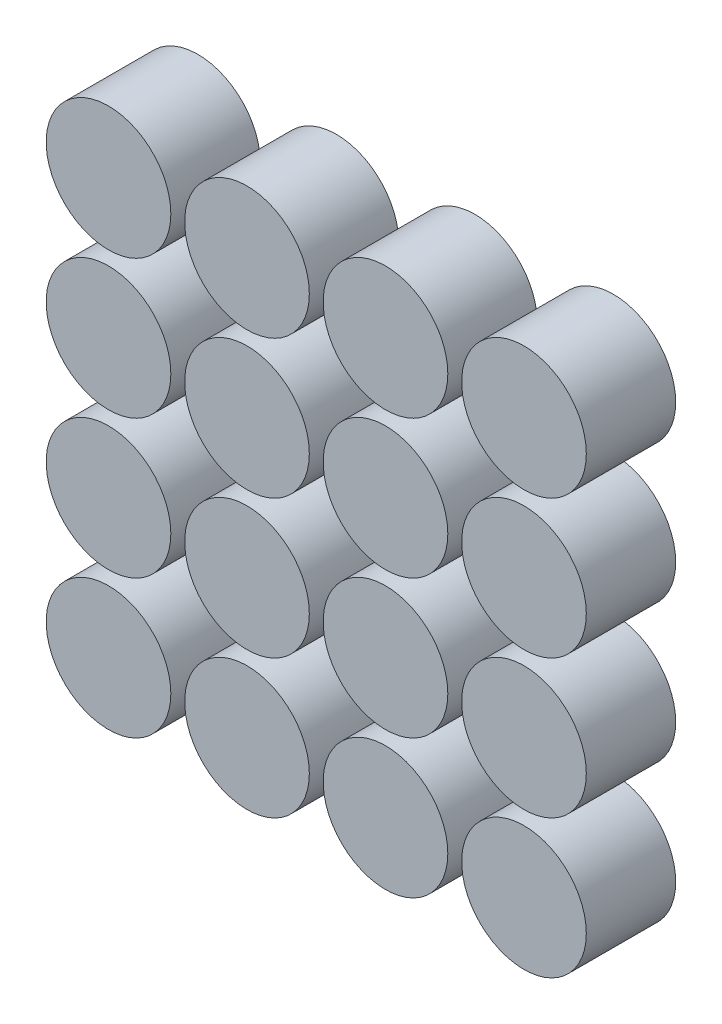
ISO-10303-21;
HEADER;
FILE_DESCRIPTION(('STEP AP214'),'2;1');
FILE_NAME('part.step','',(''),(''),'','','');
FILE_SCHEMA(('AUTOMOTIVE_DESIGN { 1 0 10303 214 1 1 1 1 }'));
ENDSEC;
DATA;
#1=APPLICATION_CONTEXT('core data for automotive mechanical design processes');
#2=APPLICATION_PROTOCOL_DEFINITION('international standard','automotive_design',2000,#1);
#3=PRODUCT_CONTEXT('',#1,'mechanical');
#4=PRODUCT('Part','Part','',(#3));
#5=PRODUCT_RELATED_PRODUCT_CATEGORY('part','',(#4));
#6=PRODUCT_DEFINITION_FORMATION('','',#4);
#7=PRODUCT_DEFINITION_CONTEXT('part definition',#1,'design');
#8=PRODUCT_DEFINITION('design','',#6,#7);
#9=PRODUCT_DEFINITION_SHAPE('','',#8);
#10=(LENGTH_UNIT() NAMED_UNIT(*) SI_UNIT(.MILLI.,.METRE.));
#11=(NAMED_UNIT(*) PLANE_ANGLE_UNIT() SI_UNIT($,.RADIAN.));
#12=(NAMED_UNIT(*) SI_UNIT($,.STERADIAN.) SOLID_ANGLE_UNIT());
#13=UNCERTAINTY_MEASURE_WITH_UNIT(LENGTH_MEASURE(1.E-05),#10,'distance_accuracy_value','');
#14=(GEOMETRIC_REPRESENTATION_CONTEXT(3) GLOBAL_UNCERTAINTY_ASSIGNED_CONTEXT((#13)) GLOBAL_UNIT_ASSIGNED_CONTEXT((#10,
#11,#12)) REPRESENTATION_CONTEXT('',''));
#15=CARTESIAN_POINT('',(0.,0.,0.));
#16=DIRECTION('',(0.,0.,1.));
#17=DIRECTION('',(1.,0.,0.));
#18=AXIS2_PLACEMENT_3D('',#15,#16,#17);
#19=CARTESIAN_POINT('',(16.5,16.5,7.1));
#20=DIRECTION('',(0.,0.,-1.));
#21=DIRECTION('',(-1.,0.,0.));
#22=AXIS2_PLACEMENT_3D('',#19,#20,#21);
#23=CYLINDRICAL_SURFACE('',#22,4.95);
#24=CARTESIAN_POINT('',(16.5,16.5,7.1));
#25=DIRECTION('',(0.,0.,1.));
#26=DIRECTION('',(1.,0.,0.));
#27=AXIS2_PLACEMENT_3D('',#24,#25,#26);
#28=CIRCLE('',#27,4.95);
#29=CARTESIAN_POINT('',(21.45,16.5,7.1));
#30=VERTEX_POINT('',#29);
#31=EDGE_CURVE('E54',#30,#30,#28,.T.);
#32=ORIENTED_EDGE('',*,*,#31,.F.);
#33=EDGE_LOOP('',(#32));
#34=FACE_BOUND('',#33,.T.);
#35=CARTESIAN_POINT('',(16.5,16.5,0.));
#36=DIRECTION('',(0.,0.,1.));
#37=DIRECTION('',(1.,0.,0.));
#38=AXIS2_PLACEMENT_3D('',#35,#36,#37);
#39=CIRCLE('',#38,4.95);
#40=CARTESIAN_POINT('',(21.45,16.5,0.));
#41=VERTEX_POINT('',#40);
#42=EDGE_CURVE('E11',#41,#41,#39,.T.);
#43=ORIENTED_EDGE('',*,*,#42,.T.);
#44=EDGE_LOOP('',(#43));
#45=FACE_BOUND('',#44,.T.);
#46=ADVANCED_FACE('F50',(#34,#45),#23,.T.);
#47=CARTESIAN_POINT('',(16.5,16.5,7.1));
#48=DIRECTION('',(0.,0.,1.));
#49=DIRECTION('',(1.,0.,0.));
#50=AXIS2_PLACEMENT_3D('',#47,#48,#49);
#51=PLANE('',#50);
#52=ORIENTED_EDGE('',*,*,#31,.T.);
#53=EDGE_LOOP('',(#52));
#54=FACE_BOUND('',#53,.T.);
#55=ADVANCED_FACE('F52',(#54),#51,.T.);
#56=CARTESIAN_POINT('',(16.5,16.5,0.));
#57=DIRECTION('',(0.,0.,1.));
#58=DIRECTION('',(1.,0.,0.));
#59=AXIS2_PLACEMENT_3D('',#56,#57,#58);
#60=PLANE('',#59);
#61=ORIENTED_EDGE('',*,*,#42,.F.);
#62=EDGE_LOOP('',(#61));
#63=FACE_BOUND('',#62,.T.);
#64=ADVANCED_FACE('F69',(#63),#60,.F.);
#65=CLOSED_SHELL('',(#46,#55,#64));
#66=MANIFOLD_SOLID_BREP('B2',#65);
#67=CARTESIAN_POINT('',(5.5,16.5,7.1));
#68=DIRECTION('',(0.,0.,-1.));
#69=DIRECTION('',(-1.,0.,0.));
#70=AXIS2_PLACEMENT_3D('',#67,#68,#69);
#71=CYLINDRICAL_SURFACE('',#70,4.95);
#72=CARTESIAN_POINT('',(5.5,16.5,7.1));
#73=DIRECTION('',(0.,0.,1.));
#74=DIRECTION('',(1.,0.,0.));
#75=AXIS2_PLACEMENT_3D('',#72,#73,#74);
#76=CIRCLE('',#75,4.95);
#77=CARTESIAN_POINT('',(10.45,16.5,7.1));
#78=VERTEX_POINT('',#77);
#79=EDGE_CURVE('E103',#78,#78,#76,.T.);
#80=ORIENTED_EDGE('',*,*,#79,.F.);
#81=EDGE_LOOP('',(#80));
#82=FACE_BOUND('',#81,.T.);
#83=CARTESIAN_POINT('',(5.5,16.5,0.));
#84=DIRECTION('',(0.,0.,1.));
#85=DIRECTION('',(1.,0.,0.));
#86=AXIS2_PLACEMENT_3D('',#83,#84,#85);
#87=CIRCLE('',#86,4.95);
#88=CARTESIAN_POINT('',(10.45,16.5,0.));
#89=VERTEX_POINT('',#88);
#90=EDGE_CURVE('E49',#89,#89,#87,.T.);
#91=ORIENTED_EDGE('',*,*,#90,.T.);
#92=EDGE_LOOP('',(#91));
#93=FACE_BOUND('',#92,.T.);
#94=ADVANCED_FACE('F99',(#82,#93),#71,.T.);
#95=CARTESIAN_POINT('',(5.5,16.5,7.1));
#96=DIRECTION('',(0.,0.,1.));
#97=DIRECTION('',(1.,0.,0.));
#98=AXIS2_PLACEMENT_3D('',#95,#96,#97);
#99=PLANE('',#98);
#100=ORIENTED_EDGE('',*,*,#79,.T.);
#101=EDGE_LOOP('',(#100));
#102=FACE_BOUND('',#101,.T.);
#103=ADVANCED_FACE('F101',(#102),#99,.T.);
#104=CARTESIAN_POINT('',(5.5,16.5,0.));
#105=DIRECTION('',(0.,0.,1.));
#106=DIRECTION('',(1.,0.,0.));
#107=AXIS2_PLACEMENT_3D('',#104,#105,#106);
#108=PLANE('',#107);
#109=ORIENTED_EDGE('',*,*,#90,.F.);
#110=EDGE_LOOP('',(#109));
#111=FACE_BOUND('',#110,.T.);
#112=ADVANCED_FACE('F118',(#111),#108,.F.);
#113=CLOSED_SHELL('',(#94,#103,#112));
#114=MANIFOLD_SOLID_BREP('B6',#113);
#115=CARTESIAN_POINT('',(-5.5,16.5,7.1));
#116=DIRECTION('',(0.,0.,-1.));
#117=DIRECTION('',(-1.,0.,0.));
#118=AXIS2_PLACEMENT_3D('',#115,#116,#117);
#119=CYLINDRICAL_SURFACE('',#118,4.95);
#120=CARTESIAN_POINT('',(-5.5,16.5,7.1));
#121=DIRECTION('',(0.,0.,1.));
#122=DIRECTION('',(1.,0.,0.));
#123=AXIS2_PLACEMENT_3D('',#120,#121,#122);
#124=CIRCLE('',#123,4.95);
#125=CARTESIAN_POINT('',(-0.549999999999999,16.5,7.1));
#126=VERTEX_POINT('',#125);
#127=EDGE_CURVE('E152',#126,#126,#124,.T.);
#128=ORIENTED_EDGE('',*,*,#127,.F.);
#129=EDGE_LOOP('',(#128));
#130=FACE_BOUND('',#129,.T.);
#131=CARTESIAN_POINT('',(-5.5,16.5,0.));
#132=DIRECTION('',(0.,0.,1.));
#133=DIRECTION('',(1.,0.,0.));
#134=AXIS2_PLACEMENT_3D('',#131,#132,#133);
#135=CIRCLE('',#134,4.95);
#136=CARTESIAN_POINT('',(-0.549999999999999,16.5,0.));
#137=VERTEX_POINT('',#136);
#138=EDGE_CURVE('E98',#137,#137,#135,.T.);
#139=ORIENTED_EDGE('',*,*,#138,.T.);
#140=EDGE_LOOP('',(#139));
#141=FACE_BOUND('',#140,.T.);
#142=ADVANCED_FACE('F148',(#130,#141),#119,.T.);
#143=CARTESIAN_POINT('',(-5.5,16.5,7.1));
#144=DIRECTION('',(0.,0.,1.));
#145=DIRECTION('',(1.,0.,0.));
#146=AXIS2_PLACEMENT_3D('',#143,#144,#145);
#147=PLANE('',#146);
#148=ORIENTED_EDGE('',*,*,#127,.T.);
#149=EDGE_LOOP('',(#148));
#150=FACE_BOUND('',#149,.T.);
#151=ADVANCED_FACE('F150',(#150),#147,.T.);
#152=CARTESIAN_POINT('',(-5.5,16.5,0.));
#153=DIRECTION('',(0.,0.,1.));
#154=DIRECTION('',(1.,0.,0.));
#155=AXIS2_PLACEMENT_3D('',#152,#153,#154);
#156=PLANE('',#155);
#157=ORIENTED_EDGE('',*,*,#138,.F.);
#158=EDGE_LOOP('',(#157));
#159=FACE_BOUND('',#158,.T.);
#160=ADVANCED_FACE('F167',(#159),#156,.F.);
#161=CLOSED_SHELL('',(#142,#151,#160));
#162=MANIFOLD_SOLID_BREP('B44',#161);
#163=CARTESIAN_POINT('',(-16.5,16.5,7.1));
#164=DIRECTION('',(0.,0.,-1.));
#165=DIRECTION('',(-1.,0.,0.));
#166=AXIS2_PLACEMENT_3D('',#163,#164,#165);
#167=CYLINDRICAL_SURFACE('',#166,4.95);
#168=CARTESIAN_POINT('',(-16.5,16.5,7.1));
#169=DIRECTION('',(0.,0.,1.));
#170=DIRECTION('',(1.,0.,0.));
#171=AXIS2_PLACEMENT_3D('',#168,#169,#170);
#172=CIRCLE('',#171,4.95);
#173=CARTESIAN_POINT('',(-11.55,16.5,7.1));
#174=VERTEX_POINT('',#173);
#175=EDGE_CURVE('E201',#174,#174,#172,.T.);
#176=ORIENTED_EDGE('',*,*,#175,.F.);
#177=EDGE_LOOP('',(#176));
#178=FACE_BOUND('',#177,.T.);
#179=CARTESIAN_POINT('',(-16.5,16.5,0.));
#180=DIRECTION('',(0.,0.,1.));
#181=DIRECTION('',(1.,0.,0.));
#182=AXIS2_PLACEMENT_3D('',#179,#180,#181);
#183=CIRCLE('',#182,4.95);
#184=CARTESIAN_POINT('',(-11.55,16.5,0.));
#185=VERTEX_POINT('',#184);
#186=EDGE_CURVE('E147',#185,#185,#183,.T.);
#187=ORIENTED_EDGE('',*,*,#186,.T.);
#188=EDGE_LOOP('',(#187));
#189=FACE_BOUND('',#188,.T.);
#190=ADVANCED_FACE('F197',(#178,#189),#167,.T.);
#191=CARTESIAN_POINT('',(-16.5,16.5,7.1));
#192=DIRECTION('',(0.,0.,1.));
#193=DIRECTION('',(1.,0.,0.));
#194=AXIS2_PLACEMENT_3D('',#191,#192,#193);
#195=PLANE('',#194);
#196=ORIENTED_EDGE('',*,*,#175,.T.);
#197=EDGE_LOOP('',(#196));
#198=FACE_BOUND('',#197,.T.);
#199=ADVANCED_FACE('F199',(#198),#195,.T.);
#200=CARTESIAN_POINT('',(-16.5,16.5,0.));
#201=DIRECTION('',(0.,0.,1.));
#202=DIRECTION('',(1.,0.,0.));
#203=AXIS2_PLACEMENT_3D('',#200,#201,#202);
#204=PLANE('',#203);
#205=ORIENTED_EDGE('',*,*,#186,.F.);
#206=EDGE_LOOP('',(#205));
#207=FACE_BOUND('',#206,.T.);
#208=ADVANCED_FACE('F216',(#207),#204,.F.);
#209=CLOSED_SHELL('',(#190,#199,#208));
#210=MANIFOLD_SOLID_BREP('B93',#209);
#211=CARTESIAN_POINT('',(16.5,5.5,7.1));
#212=DIRECTION('',(0.,0.,-1.));
#213=DIRECTION('',(-1.,0.,0.));
#214=AXIS2_PLACEMENT_3D('',#211,#212,#213);
#215=CYLINDRICAL_SURFACE('',#214,4.95);
#216=CARTESIAN_POINT('',(16.5,5.5,7.1));
#217=DIRECTION('',(0.,0.,1.));
#218=DIRECTION('',(1.,0.,0.));
#219=AXIS2_PLACEMENT_3D('',#216,#217,#218);
#220=CIRCLE('',#219,4.95);
#221=CARTESIAN_POINT('',(21.45,5.5,7.1));
#222=VERTEX_POINT('',#221);
#223=EDGE_CURVE('E250',#222,#222,#220,.T.);
#224=ORIENTED_EDGE('',*,*,#223,.F.);
#225=EDGE_LOOP('',(#224));
#226=FACE_BOUND('',#225,.T.);
#227=CARTESIAN_POINT('',(16.5,5.5,0.));
#228=DIRECTION('',(0.,0.,1.));
#229=DIRECTION('',(1.,0.,0.));
#230=AXIS2_PLACEMENT_3D('',#227,#228,#229);
#231=CIRCLE('',#230,4.95);
#232=CARTESIAN_POINT('',(21.45,5.5,0.));
#233=VERTEX_POINT('',#232);
#234=EDGE_CURVE('E196',#233,#233,#231,.T.);
#235=ORIENTED_EDGE('',*,*,#234,.T.);
#236=EDGE_LOOP('',(#235));
#237=FACE_BOUND('',#236,.T.);
#238=ADVANCED_FACE('F246',(#226,#237),#215,.T.);
#239=CARTESIAN_POINT('',(16.5,5.5,7.1));
#240=DIRECTION('',(0.,0.,1.));
#241=DIRECTION('',(1.,0.,0.));
#242=AXIS2_PLACEMENT_3D('',#239,#240,#241);
#243=PLANE('',#242);
#244=ORIENTED_EDGE('',*,*,#223,.T.);
#245=EDGE_LOOP('',(#244));
#246=FACE_BOUND('',#245,.T.);
#247=ADVANCED_FACE('F248',(#246),#243,.T.);
#248=CARTESIAN_POINT('',(16.5,5.5,0.));
#249=DIRECTION('',(0.,0.,1.));
#250=DIRECTION('',(1.,0.,0.));
#251=AXIS2_PLACEMENT_3D('',#248,#249,#250);
#252=PLANE('',#251);
#253=ORIENTED_EDGE('',*,*,#234,.F.);
#254=EDGE_LOOP('',(#253));
#255=FACE_BOUND('',#254,.T.);
#256=ADVANCED_FACE('F265',(#255),#252,.F.);
#257=CLOSED_SHELL('',(#238,#247,#256));
#258=MANIFOLD_SOLID_BREP('B142',#257);
#259=CARTESIAN_POINT('',(5.5,5.5,7.1));
#260=DIRECTION('',(0.,0.,-1.));
#261=DIRECTION('',(-1.,0.,0.));
#262=AXIS2_PLACEMENT_3D('',#259,#260,#261);
#263=CYLINDRICAL_SURFACE('',#262,4.95);
#264=CARTESIAN_POINT('',(5.5,5.5,7.1));
#265=DIRECTION('',(0.,0.,1.));
#266=DIRECTION('',(1.,0.,0.));
#267=AXIS2_PLACEMENT_3D('',#264,#265,#266);
#268=CIRCLE('',#267,4.95);
#269=CARTESIAN_POINT('',(10.45,5.5,7.1));
#270=VERTEX_POINT('',#269);
#271=EDGE_CURVE('E299',#270,#270,#268,.T.);
#272=ORIENTED_EDGE('',*,*,#271,.F.);
#273=EDGE_LOOP('',(#272));
#274=FACE_BOUND('',#273,.T.);
#275=CARTESIAN_POINT('',(5.5,5.5,0.));
#276=DIRECTION('',(0.,0.,1.));
#277=DIRECTION('',(1.,0.,0.));
#278=AXIS2_PLACEMENT_3D('',#275,#276,#277);
#279=CIRCLE('',#278,4.95);
#280=CARTESIAN_POINT('',(10.45,5.5,0.));
#281=VERTEX_POINT('',#280);
#282=EDGE_CURVE('E245',#281,#281,#279,.T.);
#283=ORIENTED_EDGE('',*,*,#282,.T.);
#284=EDGE_LOOP('',(#283));
#285=FACE_BOUND('',#284,.T.);
#286=ADVANCED_FACE('F295',(#274,#285),#263,.T.);
#287=CARTESIAN_POINT('',(5.5,5.5,7.1));
#288=DIRECTION('',(0.,0.,1.));
#289=DIRECTION('',(1.,0.,0.));
#290=AXIS2_PLACEMENT_3D('',#287,#288,#289);
#291=PLANE('',#290);
#292=ORIENTED_EDGE('',*,*,#271,.T.);
#293=EDGE_LOOP('',(#292));
#294=FACE_BOUND('',#293,.T.);
#295=ADVANCED_FACE('F297',(#294),#291,.T.);
#296=CARTESIAN_POINT('',(5.5,5.5,0.));
#297=DIRECTION('',(0.,0.,1.));
#298=DIRECTION('',(1.,0.,0.));
#299=AXIS2_PLACEMENT_3D('',#296,#297,#298);
#300=PLANE('',#299);
#301=ORIENTED_EDGE('',*,*,#282,.F.);
#302=EDGE_LOOP('',(#301));
#303=FACE_BOUND('',#302,.T.);
#304=ADVANCED_FACE('F314',(#303),#300,.F.);
#305=CLOSED_SHELL('',(#286,#295,#304));
#306=MANIFOLD_SOLID_BREP('B191',#305);
#307=CARTESIAN_POINT('',(-5.5,5.5,7.1));
#308=DIRECTION('',(0.,0.,-1.));
#309=DIRECTION('',(-1.,0.,0.));
#310=AXIS2_PLACEMENT_3D('',#307,#308,#309);
#311=CYLINDRICAL_SURFACE('',#310,4.95);
#312=CARTESIAN_POINT('',(-5.5,5.5,7.1));
#313=DIRECTION('',(0.,0.,1.));
#314=DIRECTION('',(1.,0.,0.));
#315=AXIS2_PLACEMENT_3D('',#312,#313,#314);
#316=CIRCLE('',#315,4.95);
#317=CARTESIAN_POINT('',(-0.549999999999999,5.5,7.1));
#318=VERTEX_POINT('',#317);
#319=EDGE_CURVE('E348',#318,#318,#316,.T.);
#320=ORIENTED_EDGE('',*,*,#319,.F.);
#321=EDGE_LOOP('',(#320));
#322=FACE_BOUND('',#321,.T.);
#323=CARTESIAN_POINT('',(-5.5,5.5,0.));
#324=DIRECTION('',(0.,0.,1.));
#325=DIRECTION('',(1.,0.,0.));
#326=AXIS2_PLACEMENT_3D('',#323,#324,#325);
#327=CIRCLE('',#326,4.95);
#328=CARTESIAN_POINT('',(-0.549999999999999,5.5,0.));
#329=VERTEX_POINT('',#328);
#330=EDGE_CURVE('E294',#329,#329,#327,.T.);
#331=ORIENTED_EDGE('',*,*,#330,.T.);
#332=EDGE_LOOP('',(#331));
#333=FACE_BOUND('',#332,.T.);
#334=ADVANCED_FACE('F344',(#322,#333),#311,.T.);
#335=CARTESIAN_POINT('',(-5.5,5.5,7.1));
#336=DIRECTION('',(0.,0.,1.));
#337=DIRECTION('',(1.,0.,0.));
#338=AXIS2_PLACEMENT_3D('',#335,#336,#337);
#339=PLANE('',#338);
#340=ORIENTED_EDGE('',*,*,#319,.T.);
#341=EDGE_LOOP('',(#340));
#342=FACE_BOUND('',#341,.T.);
#343=ADVANCED_FACE('F346',(#342),#339,.T.);
#344=CARTESIAN_POINT('',(-5.5,5.5,0.));
#345=DIRECTION('',(0.,0.,1.));
#346=DIRECTION('',(1.,0.,0.));
#347=AXIS2_PLACEMENT_3D('',#344,#345,#346);
#348=PLANE('',#347);
#349=ORIENTED_EDGE('',*,*,#330,.F.);
#350=EDGE_LOOP('',(#349));
#351=FACE_BOUND('',#350,.T.);
#352=ADVANCED_FACE('F363',(#351),#348,.F.);
#353=CLOSED_SHELL('',(#334,#343,#352));
#354=MANIFOLD_SOLID_BREP('B240',#353);
#355=CARTESIAN_POINT('',(-16.5,5.5,7.1));
#356=DIRECTION('',(0.,0.,-1.));
#357=DIRECTION('',(-1.,0.,0.));
#358=AXIS2_PLACEMENT_3D('',#355,#356,#357);
#359=CYLINDRICAL_SURFACE('',#358,4.95);
#360=CARTESIAN_POINT('',(-16.5,5.5,7.1));
#361=DIRECTION('',(0.,0.,1.));
#362=DIRECTION('',(1.,0.,0.));
#363=AXIS2_PLACEMENT_3D('',#360,#361,#362);
#364=CIRCLE('',#363,4.95);
#365=CARTESIAN_POINT('',(-11.55,5.5,7.1));
#366=VERTEX_POINT('',#365);
#367=EDGE_CURVE('E397',#366,#366,#364,.T.);
#368=ORIENTED_EDGE('',*,*,#367,.F.);
#369=EDGE_LOOP('',(#368));
#370=FACE_BOUND('',#369,.T.);
#371=CARTESIAN_POINT('',(-16.5,5.5,0.));
#372=DIRECTION('',(0.,0.,1.));
#373=DIRECTION('',(1.,0.,0.));
#374=AXIS2_PLACEMENT_3D('',#371,#372,#373);
#375=CIRCLE('',#374,4.95);
#376=CARTESIAN_POINT('',(-11.55,5.5,0.));
#377=VERTEX_POINT('',#376);
#378=EDGE_CURVE('E343',#377,#377,#375,.T.);
#379=ORIENTED_EDGE('',*,*,#378,.T.);
#380=EDGE_LOOP('',(#379));
#381=FACE_BOUND('',#380,.T.);
#382=ADVANCED_FACE('F393',(#370,#381),#359,.T.);
#383=CARTESIAN_POINT('',(-16.5,5.5,7.1));
#384=DIRECTION('',(0.,0.,1.));
#385=DIRECTION('',(1.,0.,0.));
#386=AXIS2_PLACEMENT_3D('',#383,#384,#385);
#387=PLANE('',#386);
#388=ORIENTED_EDGE('',*,*,#367,.T.);
#389=EDGE_LOOP('',(#388));
#390=FACE_BOUND('',#389,.T.);
#391=ADVANCED_FACE('F395',(#390),#387,.T.);
#392=CARTESIAN_POINT('',(-16.5,5.5,0.));
#393=DIRECTION('',(0.,0.,1.));
#394=DIRECTION('',(1.,0.,0.));
#395=AXIS2_PLACEMENT_3D('',#392,#393,#394);
#396=PLANE('',#395);
#397=ORIENTED_EDGE('',*,*,#378,.F.);
#398=EDGE_LOOP('',(#397));
#399=FACE_BOUND('',#398,.T.);
#400=ADVANCED_FACE('F412',(#399),#396,.F.);
#401=CLOSED_SHELL('',(#382,#391,#400));
#402=MANIFOLD_SOLID_BREP('B289',#401);
#403=CARTESIAN_POINT('',(16.5,-5.5,7.1));
#404=DIRECTION('',(0.,0.,-1.));
#405=DIRECTION('',(-1.,0.,0.));
#406=AXIS2_PLACEMENT_3D('',#403,#404,#405);
#407=CYLINDRICAL_SURFACE('',#406,4.95);
#408=CARTESIAN_POINT('',(16.5,-5.5,7.1));
#409=DIRECTION('',(0.,0.,1.));
#410=DIRECTION('',(1.,0.,0.));
#411=AXIS2_PLACEMENT_3D('',#408,#409,#410);
#412=CIRCLE('',#411,4.95);
#413=CARTESIAN_POINT('',(21.45,-5.5,7.1));
#414=VERTEX_POINT('',#413);
#415=EDGE_CURVE('E446',#414,#414,#412,.T.);
#416=ORIENTED_EDGE('',*,*,#415,.F.);
#417=EDGE_LOOP('',(#416));
#418=FACE_BOUND('',#417,.T.);
#419=CARTESIAN_POINT('',(16.5,-5.5,0.));
#420=DIRECTION('',(0.,0.,1.));
#421=DIRECTION('',(1.,0.,0.));
#422=AXIS2_PLACEMENT_3D('',#419,#420,#421);
#423=CIRCLE('',#422,4.95);
#424=CARTESIAN_POINT('',(21.45,-5.5,0.));
#425=VERTEX_POINT('',#424);
#426=EDGE_CURVE('E392',#425,#425,#423,.T.);
#427=ORIENTED_EDGE('',*,*,#426,.T.);
#428=EDGE_LOOP('',(#427));
#429=FACE_BOUND('',#428,.T.);
#430=ADVANCED_FACE('F442',(#418,#429),#407,.T.);
#431=CARTESIAN_POINT('',(16.5,-5.5,7.1));
#432=DIRECTION('',(0.,0.,1.));
#433=DIRECTION('',(1.,0.,0.));
#434=AXIS2_PLACEMENT_3D('',#431,#432,#433);
#435=PLANE('',#434);
#436=ORIENTED_EDGE('',*,*,#415,.T.);
#437=EDGE_LOOP('',(#436));
#438=FACE_BOUND('',#437,.T.);
#439=ADVANCED_FACE('F444',(#438),#435,.T.);
#440=CARTESIAN_POINT('',(16.5,-5.5,0.));
#441=DIRECTION('',(0.,0.,1.));
#442=DIRECTION('',(1.,0.,0.));
#443=AXIS2_PLACEMENT_3D('',#440,#441,#442);
#444=PLANE('',#443);
#445=ORIENTED_EDGE('',*,*,#426,.F.);
#446=EDGE_LOOP('',(#445));
#447=FACE_BOUND('',#446,.T.);
#448=ADVANCED_FACE('F461',(#447),#444,.F.);
#449=CLOSED_SHELL('',(#430,#439,#448));
#450=MANIFOLD_SOLID_BREP('B338',#449);
#451=CARTESIAN_POINT('',(5.5,-5.5,7.1));
#452=DIRECTION('',(0.,0.,-1.));
#453=DIRECTION('',(-1.,0.,0.));
#454=AXIS2_PLACEMENT_3D('',#451,#452,#453);
#455=CYLINDRICAL_SURFACE('',#454,4.95);
#456=CARTESIAN_POINT('',(5.5,-5.5,7.1));
#457=DIRECTION('',(0.,0.,1.));
#458=DIRECTION('',(1.,0.,0.));
#459=AXIS2_PLACEMENT_3D('',#456,#457,#458);
#460=CIRCLE('',#459,4.95);
#461=CARTESIAN_POINT('',(10.45,-5.5,7.1));
#462=VERTEX_POINT('',#461);
#463=EDGE_CURVE('E495',#462,#462,#460,.T.);
#464=ORIENTED_EDGE('',*,*,#463,.F.);
#465=EDGE_LOOP('',(#464));
#466=FACE_BOUND('',#465,.T.);
#467=CARTESIAN_POINT('',(5.5,-5.5,0.));
#468=DIRECTION('',(0.,0.,1.));
#469=DIRECTION('',(1.,0.,0.));
#470=AXIS2_PLACEMENT_3D('',#467,#468,#469);
#471=CIRCLE('',#470,4.95);
#472=CARTESIAN_POINT('',(10.45,-5.5,0.));
#473=VERTEX_POINT('',#472);
#474=EDGE_CURVE('E441',#473,#473,#471,.T.);
#475=ORIENTED_EDGE('',*,*,#474,.T.);
#476=EDGE_LOOP('',(#475));
#477=FACE_BOUND('',#476,.T.);
#478=ADVANCED_FACE('F491',(#466,#477),#455,.T.);
#479=CARTESIAN_POINT('',(5.5,-5.5,7.1));
#480=DIRECTION('',(0.,0.,1.));
#481=DIRECTION('',(1.,0.,0.));
#482=AXIS2_PLACEMENT_3D('',#479,#480,#481);
#483=PLANE('',#482);
#484=ORIENTED_EDGE('',*,*,#463,.T.);
#485=EDGE_LOOP('',(#484));
#486=FACE_BOUND('',#485,.T.);
#487=ADVANCED_FACE('F493',(#486),#483,.T.);
#488=CARTESIAN_POINT('',(5.5,-5.5,0.));
#489=DIRECTION('',(0.,0.,1.));
#490=DIRECTION('',(1.,0.,0.));
#491=AXIS2_PLACEMENT_3D('',#488,#489,#490);
#492=PLANE('',#491);
#493=ORIENTED_EDGE('',*,*,#474,.F.);
#494=EDGE_LOOP('',(#493));
#495=FACE_BOUND('',#494,.T.);
#496=ADVANCED_FACE('F510',(#495),#492,.F.);
#497=CLOSED_SHELL('',(#478,#487,#496));
#498=MANIFOLD_SOLID_BREP('B387',#497);
#499=CARTESIAN_POINT('',(-5.5,-5.5,7.1));
#500=DIRECTION('',(0.,0.,-1.));
#501=DIRECTION('',(-1.,0.,0.));
#502=AXIS2_PLACEMENT_3D('',#499,#500,#501);
#503=CYLINDRICAL_SURFACE('',#502,4.95);
#504=CARTESIAN_POINT('',(-5.5,-5.5,7.1));
#505=DIRECTION('',(0.,0.,1.));
#506=DIRECTION('',(1.,0.,0.));
#507=AXIS2_PLACEMENT_3D('',#504,#505,#506);
#508=CIRCLE('',#507,4.95);
#509=CARTESIAN_POINT('',(-0.549999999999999,-5.5,7.1));
#510=VERTEX_POINT('',#509);
#511=EDGE_CURVE('E544',#510,#510,#508,.T.);
#512=ORIENTED_EDGE('',*,*,#511,.F.);
#513=EDGE_LOOP('',(#512));
#514=FACE_BOUND('',#513,.T.);
#515=CARTESIAN_POINT('',(-5.5,-5.5,0.));
#516=DIRECTION('',(0.,0.,1.));
#517=DIRECTION('',(1.,0.,0.));
#518=AXIS2_PLACEMENT_3D('',#515,#516,#517);
#519=CIRCLE('',#518,4.95);
#520=CARTESIAN_POINT('',(-0.549999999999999,-5.5,0.));
#521=VERTEX_POINT('',#520);
#522=EDGE_CURVE('E490',#521,#521,#519,.T.);
#523=ORIENTED_EDGE('',*,*,#522,.T.);
#524=EDGE_LOOP('',(#523));
#525=FACE_BOUND('',#524,.T.);
#526=ADVANCED_FACE('F540',(#514,#525),#503,.T.);
#527=CARTESIAN_POINT('',(-5.5,-5.5,7.1));
#528=DIRECTION('',(0.,0.,1.));
#529=DIRECTION('',(1.,0.,0.));
#530=AXIS2_PLACEMENT_3D('',#527,#528,#529);
#531=PLANE('',#530);
#532=ORIENTED_EDGE('',*,*,#511,.T.);
#533=EDGE_LOOP('',(#532));
#534=FACE_BOUND('',#533,.T.);
#535=ADVANCED_FACE('F542',(#534),#531,.T.);
#536=CARTESIAN_POINT('',(-5.5,-5.5,0.));
#537=DIRECTION('',(0.,0.,1.));
#538=DIRECTION('',(1.,0.,0.));
#539=AXIS2_PLACEMENT_3D('',#536,#537,#538);
#540=PLANE('',#539);
#541=ORIENTED_EDGE('',*,*,#522,.F.);
#542=EDGE_LOOP('',(#541));
#543=FACE_BOUND('',#542,.T.);
#544=ADVANCED_FACE('F559',(#543),#540,.F.);
#545=CLOSED_SHELL('',(#526,#535,#544));
#546=MANIFOLD_SOLID_BREP('B436',#545);
#547=CARTESIAN_POINT('',(-16.5,-5.5,7.1));
#548=DIRECTION('',(0.,0.,-1.));
#549=DIRECTION('',(-1.,0.,0.));
#550=AXIS2_PLACEMENT_3D('',#547,#548,#549);
#551=CYLINDRICAL_SURFACE('',#550,4.95);
#552=CARTESIAN_POINT('',(-16.5,-5.5,7.1));
#553=DIRECTION('',(0.,0.,1.));
#554=DIRECTION('',(1.,0.,0.));
#555=AXIS2_PLACEMENT_3D('',#552,#553,#554);
#556=CIRCLE('',#555,4.95);
#557=CARTESIAN_POINT('',(-11.55,-5.5,7.1));
#558=VERTEX_POINT('',#557);
#559=EDGE_CURVE('E593',#558,#558,#556,.T.);
#560=ORIENTED_EDGE('',*,*,#559,.F.);
#561=EDGE_LOOP('',(#560));
#562=FACE_BOUND('',#561,.T.);
#563=CARTESIAN_POINT('',(-16.5,-5.5,0.));
#564=DIRECTION('',(0.,0.,1.));
#565=DIRECTION('',(1.,0.,0.));
#566=AXIS2_PLACEMENT_3D('',#563,#564,#565);
#567=CIRCLE('',#566,4.95);
#568=CARTESIAN_POINT('',(-11.55,-5.5,0.));
#569=VERTEX_POINT('',#568);
#570=EDGE_CURVE('E539',#569,#569,#567,.T.);
#571=ORIENTED_EDGE('',*,*,#570,.T.);
#572=EDGE_LOOP('',(#571));
#573=FACE_BOUND('',#572,.T.);
#574=ADVANCED_FACE('F589',(#562,#573),#551,.T.);
#575=CARTESIAN_POINT('',(-16.5,-5.5,7.1));
#576=DIRECTION('',(0.,0.,1.));
#577=DIRECTION('',(1.,0.,0.));
#578=AXIS2_PLACEMENT_3D('',#575,#576,#577);
#579=PLANE('',#578);
#580=ORIENTED_EDGE('',*,*,#559,.T.);
#581=EDGE_LOOP('',(#580));
#582=FACE_BOUND('',#581,.T.);
#583=ADVANCED_FACE('F591',(#582),#579,.T.);
#584=CARTESIAN_POINT('',(-16.5,-5.5,0.));
#585=DIRECTION('',(0.,0.,1.));
#586=DIRECTION('',(1.,0.,0.));
#587=AXIS2_PLACEMENT_3D('',#584,#585,#586);
#588=PLANE('',#587);
#589=ORIENTED_EDGE('',*,*,#570,.F.);
#590=EDGE_LOOP('',(#589));
#591=FACE_BOUND('',#590,.T.);
#592=ADVANCED_FACE('F608',(#591),#588,.F.);
#593=CLOSED_SHELL('',(#574,#583,#592));
#594=MANIFOLD_SOLID_BREP('B485',#593);
#595=CARTESIAN_POINT('',(16.5,-16.5,7.1));
#596=DIRECTION('',(0.,0.,-1.));
#597=DIRECTION('',(-1.,0.,0.));
#598=AXIS2_PLACEMENT_3D('',#595,#596,#597);
#599=CYLINDRICAL_SURFACE('',#598,4.95);
#600=CARTESIAN_POINT('',(16.5,-16.5,7.1));
#601=DIRECTION('',(0.,0.,1.));
#602=DIRECTION('',(1.,0.,0.));
#603=AXIS2_PLACEMENT_3D('',#600,#601,#602);
#604=CIRCLE('',#603,4.95);
#605=CARTESIAN_POINT('',(21.45,-16.5,7.1));
#606=VERTEX_POINT('',#605);
#607=EDGE_CURVE('E642',#606,#606,#604,.T.);
#608=ORIENTED_EDGE('',*,*,#607,.F.);
#609=EDGE_LOOP('',(#608));
#610=FACE_BOUND('',#609,.T.);
#611=CARTESIAN_POINT('',(16.5,-16.5,0.));
#612=DIRECTION('',(0.,0.,1.));
#613=DIRECTION('',(1.,0.,0.));
#614=AXIS2_PLACEMENT_3D('',#611,#612,#613);
#615=CIRCLE('',#614,4.95);
#616=CARTESIAN_POINT('',(21.45,-16.5,0.));
#617=VERTEX_POINT('',#616);
#618=EDGE_CURVE('E588',#617,#617,#615,.T.);
#619=ORIENTED_EDGE('',*,*,#618,.T.);
#620=EDGE_LOOP('',(#619));
#621=FACE_BOUND('',#620,.T.);
#622=ADVANCED_FACE('F638',(#610,#621),#599,.T.);
#623=CARTESIAN_POINT('',(16.5,-16.5,7.1));
#624=DIRECTION('',(0.,0.,1.));
#625=DIRECTION('',(1.,0.,0.));
#626=AXIS2_PLACEMENT_3D('',#623,#624,#625);
#627=PLANE('',#626);
#628=ORIENTED_EDGE('',*,*,#607,.T.);
#629=EDGE_LOOP('',(#628));
#630=FACE_BOUND('',#629,.T.);
#631=ADVANCED_FACE('F640',(#630),#627,.T.);
#632=CARTESIAN_POINT('',(16.5,-16.5,0.));
#633=DIRECTION('',(0.,0.,1.));
#634=DIRECTION('',(1.,0.,0.));
#635=AXIS2_PLACEMENT_3D('',#632,#633,#634);
#636=PLANE('',#635);
#637=ORIENTED_EDGE('',*,*,#618,.F.);
#638=EDGE_LOOP('',(#637));
#639=FACE_BOUND('',#638,.T.);
#640=ADVANCED_FACE('F657',(#639),#636,.F.);
#641=CLOSED_SHELL('',(#622,#631,#640));
#642=MANIFOLD_SOLID_BREP('B534',#641);
#643=CARTESIAN_POINT('',(5.5,-16.5,7.1));
#644=DIRECTION('',(0.,0.,-1.));
#645=DIRECTION('',(-1.,0.,0.));
#646=AXIS2_PLACEMENT_3D('',#643,#644,#645);
#647=CYLINDRICAL_SURFACE('',#646,4.95);
#648=CARTESIAN_POINT('',(5.5,-16.5,7.1));
#649=DIRECTION('',(0.,0.,1.));
#650=DIRECTION('',(1.,0.,0.));
#651=AXIS2_PLACEMENT_3D('',#648,#649,#650);
#652=CIRCLE('',#651,4.95);
#653=CARTESIAN_POINT('',(10.45,-16.5,7.1));
#654=VERTEX_POINT('',#653);
#655=EDGE_CURVE('E691',#654,#654,#652,.T.);
#656=ORIENTED_EDGE('',*,*,#655,.F.);
#657=EDGE_LOOP('',(#656));
#658=FACE_BOUND('',#657,.T.);
#659=CARTESIAN_POINT('',(5.5,-16.5,0.));
#660=DIRECTION('',(0.,0.,1.));
#661=DIRECTION('',(1.,0.,0.));
#662=AXIS2_PLACEMENT_3D('',#659,#660,#661);
#663=CIRCLE('',#662,4.95);
#664=CARTESIAN_POINT('',(10.45,-16.5,0.));
#665=VERTEX_POINT('',#664);
#666=EDGE_CURVE('E637',#665,#665,#663,.T.);
#667=ORIENTED_EDGE('',*,*,#666,.T.);
#668=EDGE_LOOP('',(#667));
#669=FACE_BOUND('',#668,.T.);
#670=ADVANCED_FACE('F687',(#658,#669),#647,.T.);
#671=CARTESIAN_POINT('',(5.5,-16.5,7.1));
#672=DIRECTION('',(0.,0.,1.));
#673=DIRECTION('',(1.,0.,0.));
#674=AXIS2_PLACEMENT_3D('',#671,#672,#673);
#675=PLANE('',#674);
#676=ORIENTED_EDGE('',*,*,#655,.T.);
#677=EDGE_LOOP('',(#676));
#678=FACE_BOUND('',#677,.T.);
#679=ADVANCED_FACE('F689',(#678),#675,.T.);
#680=CARTESIAN_POINT('',(5.5,-16.5,0.));
#681=DIRECTION('',(0.,0.,1.));
#682=DIRECTION('',(1.,0.,0.));
#683=AXIS2_PLACEMENT_3D('',#680,#681,#682);
#684=PLANE('',#683);
#685=ORIENTED_EDGE('',*,*,#666,.F.);
#686=EDGE_LOOP('',(#685));
#687=FACE_BOUND('',#686,.T.);
#688=ADVANCED_FACE('F706',(#687),#684,.F.);
#689=CLOSED_SHELL('',(#670,#679,#688));
#690=MANIFOLD_SOLID_BREP('B583',#689);
#691=CARTESIAN_POINT('',(-5.5,-16.5,7.1));
#692=DIRECTION('',(0.,0.,-1.));
#693=DIRECTION('',(-1.,0.,0.));
#694=AXIS2_PLACEMENT_3D('',#691,#692,#693);
#695=CYLINDRICAL_SURFACE('',#694,4.95);
#696=CARTESIAN_POINT('',(-5.5,-16.5,7.1));
#697=DIRECTION('',(0.,0.,1.));
#698=DIRECTION('',(1.,0.,0.));
#699=AXIS2_PLACEMENT_3D('',#696,#697,#698);
#700=CIRCLE('',#699,4.95);
#701=CARTESIAN_POINT('',(-0.549999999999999,-16.5,7.1));
#702=VERTEX_POINT('',#701);
#703=EDGE_CURVE('E739',#702,#702,#700,.T.);
#704=ORIENTED_EDGE('',*,*,#703,.F.);
#705=EDGE_LOOP('',(#704));
#706=FACE_BOUND('',#705,.T.);
#707=CARTESIAN_POINT('',(-5.5,-16.5,0.));
#708=DIRECTION('',(0.,0.,1.));
#709=DIRECTION('',(1.,0.,0.));
#710=AXIS2_PLACEMENT_3D('',#707,#708,#709);
#711=CIRCLE('',#710,4.95);
#712=CARTESIAN_POINT('',(-0.549999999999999,-16.5,0.));
#713=VERTEX_POINT('',#712);
#714=EDGE_CURVE('E686',#713,#713,#711,.T.);
#715=ORIENTED_EDGE('',*,*,#714,.T.);
#716=EDGE_LOOP('',(#715));
#717=FACE_BOUND('',#716,.T.);
#718=ADVANCED_FACE('F735',(#706,#717),#695,.T.);
#719=CARTESIAN_POINT('',(-5.5,-16.5,7.1));
#720=DIRECTION('',(0.,0.,1.));
#721=DIRECTION('',(1.,0.,0.));
#722=AXIS2_PLACEMENT_3D('',#719,#720,#721);
#723=PLANE('',#722);
#724=ORIENTED_EDGE('',*,*,#703,.T.);
#725=EDGE_LOOP('',(#724));
#726=FACE_BOUND('',#725,.T.);
#727=ADVANCED_FACE('F737',(#726),#723,.T.);
#728=CARTESIAN_POINT('',(-5.5,-16.5,0.));
#729=DIRECTION('',(0.,0.,1.));
#730=DIRECTION('',(1.,0.,0.));
#731=AXIS2_PLACEMENT_3D('',#728,#729,#730);
#732=PLANE('',#731);
#733=ORIENTED_EDGE('',*,*,#714,.F.);
#734=EDGE_LOOP('',(#733));
#735=FACE_BOUND('',#734,.T.);
#736=ADVANCED_FACE('F754',(#735),#732,.F.);
#737=CLOSED_SHELL('',(#718,#727,#736));
#738=MANIFOLD_SOLID_BREP('B632',#737);
#739=CARTESIAN_POINT('',(-16.5,-16.5,7.1));
#740=DIRECTION('',(0.,0.,-1.));
#741=DIRECTION('',(-1.,0.,0.));
#742=AXIS2_PLACEMENT_3D('',#739,#740,#741);
#743=CYLINDRICAL_SURFACE('',#742,4.95);
#744=CARTESIAN_POINT('',(-16.5,-16.5,7.1));
#745=DIRECTION('',(0.,0.,1.));
#746=DIRECTION('',(1.,0.,0.));
#747=AXIS2_PLACEMENT_3D('',#744,#745,#746);
#748=CIRCLE('',#747,4.95);
#749=CARTESIAN_POINT('',(-11.55,-16.5,7.1));
#750=VERTEX_POINT('',#749);
#751=EDGE_CURVE('E734',#750,#750,#748,.T.);
#752=ORIENTED_EDGE('',*,*,#751,.F.);
#753=EDGE_LOOP('',(#752));
#754=FACE_BOUND('',#753,.T.);
#755=CARTESIAN_POINT('',(-16.5,-16.5,0.));
#756=DIRECTION('',(0.,0.,1.));
#757=DIRECTION('',(1.,0.,0.));
#758=AXIS2_PLACEMENT_3D('',#755,#756,#757);
#759=CIRCLE('',#758,4.95);
#760=CARTESIAN_POINT('',(-11.55,-16.5,0.));
#761=VERTEX_POINT('',#760);
#762=EDGE_CURVE('E779',#761,#761,#759,.T.);
#763=ORIENTED_EDGE('',*,*,#762,.T.);
#764=EDGE_LOOP('',(#763));
#765=FACE_BOUND('',#764,.T.);
#766=ADVANCED_FACE('F776',(#754,#765),#743,.T.);
#767=CARTESIAN_POINT('',(-16.5,-16.5,7.1));
#768=DIRECTION('',(0.,0.,1.));
#769=DIRECTION('',(1.,0.,0.));
#770=AXIS2_PLACEMENT_3D('',#767,#768,#769);
#771=PLANE('',#770);
#772=ORIENTED_EDGE('',*,*,#751,.T.);
#773=EDGE_LOOP('',(#772));
#774=FACE_BOUND('',#773,.T.);
#775=ADVANCED_FACE('F791',(#774),#771,.T.);
#776=CARTESIAN_POINT('',(-16.5,-16.5,0.));
#777=DIRECTION('',(0.,0.,1.));
#778=DIRECTION('',(1.,0.,0.));
#779=AXIS2_PLACEMENT_3D('',#776,#777,#778);
#780=PLANE('',#779);
#781=ORIENTED_EDGE('',*,*,#762,.F.);
#782=EDGE_LOOP('',(#781));
#783=FACE_BOUND('',#782,.T.);
#784=ADVANCED_FACE('F789',(#783),#780,.F.);
#785=CLOSED_SHELL('',(#766,#775,#784));
#786=MANIFOLD_SOLID_BREP('B681',#785);
#787=ADVANCED_BREP_SHAPE_REPRESENTATION('',(#18,#66,#114,#162,#210,#258,#306,#354,#402,#450,
#498,#546,#594,#642,#690,#738,#786),#14);
#788=SHAPE_DEFINITION_REPRESENTATION(#9,#787);
ENDSEC;
END-ISO-10303-21;
